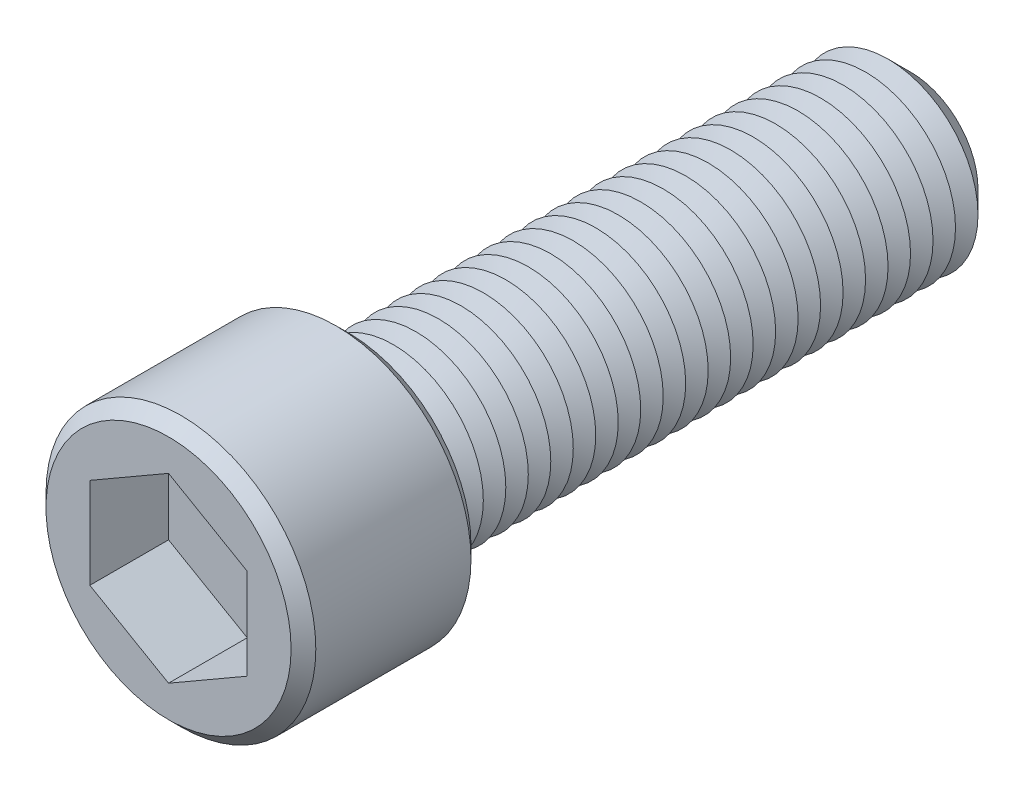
ISO-10303-21;
HEADER;
FILE_DESCRIPTION(('STEP AP214'),'2;1');
FILE_NAME('part.step','',(''),(''),'','','');
FILE_SCHEMA(('AUTOMOTIVE_DESIGN { 1 0 10303 214 1 1 1 1 }'));
ENDSEC;
DATA;
#1=APPLICATION_CONTEXT('core data for automotive mechanical design processes');
#2=APPLICATION_PROTOCOL_DEFINITION('international standard','automotive_design',2000,#1);
#3=PRODUCT_CONTEXT('',#1,'mechanical');
#4=PRODUCT('Part','Part','',(#3));
#5=PRODUCT_RELATED_PRODUCT_CATEGORY('part','',(#4));
#6=PRODUCT_DEFINITION_FORMATION('','',#4);
#7=PRODUCT_DEFINITION_CONTEXT('part definition',#1,'design');
#8=PRODUCT_DEFINITION('design','',#6,#7);
#9=PRODUCT_DEFINITION_SHAPE('','',#8);
#10=(LENGTH_UNIT() NAMED_UNIT(*) SI_UNIT(.MILLI.,.METRE.));
#11=(NAMED_UNIT(*) PLANE_ANGLE_UNIT() SI_UNIT($,.RADIAN.));
#12=(NAMED_UNIT(*) SI_UNIT($,.STERADIAN.) SOLID_ANGLE_UNIT());
#13=UNCERTAINTY_MEASURE_WITH_UNIT(LENGTH_MEASURE(1.E-05),#10,'distance_accuracy_value','');
#14=(GEOMETRIC_REPRESENTATION_CONTEXT(3) GLOBAL_UNCERTAINTY_ASSIGNED_CONTEXT((#13)) GLOBAL_UNIT_ASSIGNED_CONTEXT((#10,
#11,#12)) REPRESENTATION_CONTEXT('',''));
#15=CARTESIAN_POINT('',(0.,0.,0.));
#16=DIRECTION('',(0.,0.,1.));
#17=DIRECTION('',(1.,0.,0.));
#18=AXIS2_PLACEMENT_3D('',#15,#16,#17);
#19=CARTESIAN_POINT('',(0.,0.,16.));
#20=DIRECTION('',(0.,0.,-1.));
#21=DIRECTION('',(-1.,0.,0.));
#22=AXIS2_PLACEMENT_3D('',#19,#20,#21);
#23=CYLINDRICAL_SURFACE('',#22,12.);
#24=CARTESIAN_POINT('',(0.,0.,1.10000000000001));
#25=DIRECTION('',(0.,0.,1.));
#26=DIRECTION('',(1.,0.,0.));
#27=AXIS2_PLACEMENT_3D('',#24,#25,#26);
#28=CIRCLE('',#27,12.);
#29=CARTESIAN_POINT('',(12.,0.,1.10000000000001));
#30=VERTEX_POINT('',#29);
#31=EDGE_CURVE('E368',#30,#30,#28,.T.);
#32=ORIENTED_EDGE('',*,*,#31,.T.);
#33=EDGE_LOOP('',(#32));
#34=FACE_BOUND('',#33,.T.);
#35=CARTESIAN_POINT('',(0.,0.,14.9));
#36=DIRECTION('',(0.,0.,1.));
#37=DIRECTION('',(1.,0.,0.));
#38=AXIS2_PLACEMENT_3D('',#35,#36,#37);
#39=CIRCLE('',#38,12.);
#40=CARTESIAN_POINT('',(12.,0.,14.9));
#41=VERTEX_POINT('',#40);
#42=EDGE_CURVE('E364',#41,#41,#39,.F.);
#43=ORIENTED_EDGE('',*,*,#42,.T.);
#44=EDGE_LOOP('',(#43));
#45=FACE_BOUND('',#44,.T.);
#46=ADVANCED_FACE('F39',(#34,#45),#23,.T.);
#47=CARTESIAN_POINT('',(0.,0.,16.));
#48=DIRECTION('',(0.,0.,1.));
#49=DIRECTION('',(1.,0.,0.));
#50=AXIS2_PLACEMENT_3D('',#47,#48,#49);
#51=PLANE('',#50);
#52=CARTESIAN_POINT('',(0.,0.,16.));
#53=DIRECTION('',(0.,0.,1.));
#54=DIRECTION('',(1.,0.,0.));
#55=AXIS2_PLACEMENT_3D('',#52,#53,#54);
#56=CIRCLE('',#55,10.9);
#57=CARTESIAN_POINT('',(10.9,0.,16.));
#58=VERTEX_POINT('',#57);
#59=EDGE_CURVE('E11',#58,#58,#56,.T.);
#60=ORIENTED_EDGE('',*,*,#59,.T.);
#61=EDGE_LOOP('',(#60));
#62=FACE_BOUND('',#61,.T.);
#63=DIRECTION('',(-0.866025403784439,0.5,0.));
#64=VECTOR('',#63,1.);
#65=CARTESIAN_POINT('',(7.,4.04145188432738,16.));
#66=LINE('',#65,#64);
#67=CARTESIAN_POINT('',(7.,4.04145188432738,16.));
#68=VERTEX_POINT('',#67);
#69=CARTESIAN_POINT('',(0.,8.08290376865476,16.));
#70=VERTEX_POINT('',#69);
#71=EDGE_CURVE('E55',#68,#70,#66,.T.);
#72=ORIENTED_EDGE('',*,*,#71,.F.);
#73=DIRECTION('',(0.,1.,0.));
#74=VECTOR('',#73,1.);
#75=CARTESIAN_POINT('',(7.,-4.04145188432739,16.));
#76=LINE('',#75,#74);
#77=CARTESIAN_POINT('',(7.,-4.04145188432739,16.));
#78=VERTEX_POINT('',#77);
#79=EDGE_CURVE('E151',#78,#68,#76,.T.);
#80=ORIENTED_EDGE('',*,*,#79,.F.);
#81=DIRECTION('',(0.866025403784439,0.5,0.));
#82=VECTOR('',#81,1.);
#83=CARTESIAN_POINT('',(0.,-8.08290376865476,16.));
#84=LINE('',#83,#82);
#85=CARTESIAN_POINT('',(0.,-8.08290376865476,16.));
#86=VERTEX_POINT('',#85);
#87=EDGE_CURVE('E148',#86,#78,#84,.T.);
#88=ORIENTED_EDGE('',*,*,#87,.F.);
#89=DIRECTION('',(0.866025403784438,-0.5,0.));
#90=VECTOR('',#89,1.);
#91=CARTESIAN_POINT('',(-7.,-4.04145188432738,16.));
#92=LINE('',#91,#90);
#93=CARTESIAN_POINT('',(-7.,-4.04145188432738,16.));
#94=VERTEX_POINT('',#93);
#95=EDGE_CURVE('E103',#94,#86,#92,.T.);
#96=ORIENTED_EDGE('',*,*,#95,.F.);
#97=DIRECTION('',(0.,-1.,0.));
#98=VECTOR('',#97,1.);
#99=CARTESIAN_POINT('',(-7.,4.04145188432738,16.));
#100=LINE('',#99,#98);
#101=CARTESIAN_POINT('',(-7.,4.04145188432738,16.));
#102=VERTEX_POINT('',#101);
#103=EDGE_CURVE('E142',#102,#94,#100,.T.);
#104=ORIENTED_EDGE('',*,*,#103,.F.);
#105=DIRECTION('',(-0.866025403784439,-0.5,0.));
#106=VECTOR('',#105,1.);
#107=CARTESIAN_POINT('',(0.,8.08290376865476,16.));
#108=LINE('',#107,#106);
#109=EDGE_CURVE('E137',#70,#102,#108,.T.);
#110=ORIENTED_EDGE('',*,*,#109,.F.);
#111=EDGE_LOOP('',(#72,#80,#88,#96,#104,#110));
#112=FACE_BOUND('',#111,.T.);
#113=ADVANCED_FACE('F386',(#62,#112),#51,.T.);
#114=CARTESIAN_POINT('',(0.,0.,0.));
#115=DIRECTION('',(0.,0.,1.));
#116=DIRECTION('',(1.,0.,0.));
#117=AXIS2_PLACEMENT_3D('',#114,#115,#116);
#118=PLANE('',#117);
#119=CARTESIAN_POINT('',(0.,0.,0.));
#120=DIRECTION('',(0.,0.,1.));
#121=DIRECTION('',(1.,0.,0.));
#122=AXIS2_PLACEMENT_3D('',#119,#120,#121);
#123=CIRCLE('',#122,10.9);
#124=CARTESIAN_POINT('',(10.9,0.,0.));
#125=VERTEX_POINT('',#124);
#126=EDGE_CURVE('E48',#125,#125,#123,.F.);
#127=ORIENTED_EDGE('',*,*,#126,.T.);
#128=EDGE_LOOP('',(#127));
#129=FACE_BOUND('',#128,.T.);
#130=CARTESIAN_POINT('',(0.,0.,0.));
#131=DIRECTION('',(0.,0.,1.));
#132=DIRECTION('',(1.,0.,0.));
#133=AXIS2_PLACEMENT_3D('',#130,#131,#132);
#134=CIRCLE('',#133,8.);
#135=CARTESIAN_POINT('',(8.,0.,0.));
#136=VERTEX_POINT('',#135);
#137=EDGE_CURVE('E356',#136,#136,#134,.T.);
#138=ORIENTED_EDGE('',*,*,#137,.T.);
#139=EDGE_LOOP('',(#138));
#140=FACE_BOUND('',#139,.T.);
#141=ADVANCED_FACE('F375',(#129,#140),#118,.F.);
#142=CARTESIAN_POINT('',(0.,0.,0.));
#143=DIRECTION('',(0.,0.,1.));
#144=DIRECTION('',(1.,0.,0.));
#145=AXIS2_PLACEMENT_3D('',#142,#143,#144);
#146=CONICAL_SURFACE('',#145,8.,1.0471975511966);
#147=CARTESIAN_POINT('',(0.,0.,-1.));
#148=DIRECTION('',(0.,0.,1.));
#149=DIRECTION('',(1.,0.,0.));
#150=AXIS2_PLACEMENT_3D('',#147,#148,#149);
#151=CIRCLE('',#150,6.26794919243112);
#152=CARTESIAN_POINT('',(6.26794919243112,0.,-1.));
#153=VERTEX_POINT('',#152);
#154=EDGE_CURVE('E352',#153,#153,#151,.T.);
#155=ORIENTED_EDGE('',*,*,#154,.T.);
#156=EDGE_LOOP('',(#155));
#157=FACE_BOUND('',#156,.T.);
#158=ORIENTED_EDGE('',*,*,#137,.F.);
#159=EDGE_LOOP('',(#158));
#160=FACE_BOUND('',#159,.T.);
#161=ADVANCED_FACE('F628',(#157,#160),#146,.T.);
#162=CARTESIAN_POINT('',(0.,0.,-1.));
#163=DIRECTION('',(0.,0.,-1.));
#164=DIRECTION('',(-1.,0.,0.));
#165=AXIS2_PLACEMENT_3D('',#162,#163,#164);
#166=CONICAL_SURFACE('',#165,6.26794919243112,1.0471975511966);
#167=CARTESIAN_POINT('',(0.,0.,-2.));
#168=DIRECTION('',(0.,0.,1.));
#169=DIRECTION('',(1.,0.,0.));
#170=AXIS2_PLACEMENT_3D('',#167,#168,#169);
#171=CIRCLE('',#170,8.);
#172=CARTESIAN_POINT('',(8.,0.,-2.));
#173=VERTEX_POINT('',#172);
#174=EDGE_CURVE('E348',#173,#173,#171,.T.);
#175=ORIENTED_EDGE('',*,*,#174,.T.);
#176=EDGE_LOOP('',(#175));
#177=FACE_BOUND('',#176,.T.);
#178=ORIENTED_EDGE('',*,*,#154,.F.);
#179=EDGE_LOOP('',(#178));
#180=FACE_BOUND('',#179,.T.);
#181=ADVANCED_FACE('F624',(#177,#180),#166,.T.);
#182=CARTESIAN_POINT('',(0.,0.,-2.));
#183=DIRECTION('',(0.,0.,1.));
#184=DIRECTION('',(1.,0.,0.));
#185=AXIS2_PLACEMENT_3D('',#182,#183,#184);
#186=CONICAL_SURFACE('',#185,8.,1.0471975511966);
#187=CARTESIAN_POINT('',(0.,0.,-3.));
#188=DIRECTION('',(0.,0.,1.));
#189=DIRECTION('',(1.,0.,0.));
#190=AXIS2_PLACEMENT_3D('',#187,#188,#189);
#191=CIRCLE('',#190,6.26794919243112);
#192=CARTESIAN_POINT('',(6.26794919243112,0.,-3.));
#193=VERTEX_POINT('',#192);
#194=EDGE_CURVE('E344',#193,#193,#191,.T.);
#195=ORIENTED_EDGE('',*,*,#194,.T.);
#196=EDGE_LOOP('',(#195));
#197=FACE_BOUND('',#196,.T.);
#198=ORIENTED_EDGE('',*,*,#174,.F.);
#199=EDGE_LOOP('',(#198));
#200=FACE_BOUND('',#199,.T.);
#201=ADVANCED_FACE('F620',(#197,#200),#186,.T.);
#202=CARTESIAN_POINT('',(0.,0.,-3.));
#203=DIRECTION('',(0.,0.,-1.));
#204=DIRECTION('',(-1.,0.,0.));
#205=AXIS2_PLACEMENT_3D('',#202,#203,#204);
#206=CONICAL_SURFACE('',#205,6.26794919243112,1.0471975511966);
#207=CARTESIAN_POINT('',(0.,0.,-4.));
#208=DIRECTION('',(0.,0.,1.));
#209=DIRECTION('',(1.,0.,0.));
#210=AXIS2_PLACEMENT_3D('',#207,#208,#209);
#211=CIRCLE('',#210,8.);
#212=CARTESIAN_POINT('',(8.,0.,-4.));
#213=VERTEX_POINT('',#212);
#214=EDGE_CURVE('E340',#213,#213,#211,.T.);
#215=ORIENTED_EDGE('',*,*,#214,.T.);
#216=EDGE_LOOP('',(#215));
#217=FACE_BOUND('',#216,.T.);
#218=ORIENTED_EDGE('',*,*,#194,.F.);
#219=EDGE_LOOP('',(#218));
#220=FACE_BOUND('',#219,.T.);
#221=ADVANCED_FACE('F616',(#217,#220),#206,.T.);
#222=CARTESIAN_POINT('',(0.,0.,-4.));
#223=DIRECTION('',(0.,0.,1.));
#224=DIRECTION('',(1.,0.,0.));
#225=AXIS2_PLACEMENT_3D('',#222,#223,#224);
#226=CONICAL_SURFACE('',#225,8.,1.0471975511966);
#227=CARTESIAN_POINT('',(0.,0.,-5.));
#228=DIRECTION('',(0.,0.,1.));
#229=DIRECTION('',(1.,0.,0.));
#230=AXIS2_PLACEMENT_3D('',#227,#228,#229);
#231=CIRCLE('',#230,6.26794919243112);
#232=CARTESIAN_POINT('',(6.26794919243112,0.,-5.));
#233=VERTEX_POINT('',#232);
#234=EDGE_CURVE('E336',#233,#233,#231,.T.);
#235=ORIENTED_EDGE('',*,*,#234,.T.);
#236=EDGE_LOOP('',(#235));
#237=FACE_BOUND('',#236,.T.);
#238=ORIENTED_EDGE('',*,*,#214,.F.);
#239=EDGE_LOOP('',(#238));
#240=FACE_BOUND('',#239,.T.);
#241=ADVANCED_FACE('F612',(#237,#240),#226,.T.);
#242=CARTESIAN_POINT('',(0.,0.,-5.));
#243=DIRECTION('',(0.,0.,-1.));
#244=DIRECTION('',(-1.,0.,0.));
#245=AXIS2_PLACEMENT_3D('',#242,#243,#244);
#246=CONICAL_SURFACE('',#245,6.26794919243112,1.0471975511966);
#247=CARTESIAN_POINT('',(0.,0.,-6.));
#248=DIRECTION('',(0.,0.,1.));
#249=DIRECTION('',(1.,0.,0.));
#250=AXIS2_PLACEMENT_3D('',#247,#248,#249);
#251=CIRCLE('',#250,8.);
#252=CARTESIAN_POINT('',(8.,0.,-6.));
#253=VERTEX_POINT('',#252);
#254=EDGE_CURVE('E332',#253,#253,#251,.T.);
#255=ORIENTED_EDGE('',*,*,#254,.T.);
#256=EDGE_LOOP('',(#255));
#257=FACE_BOUND('',#256,.T.);
#258=ORIENTED_EDGE('',*,*,#234,.F.);
#259=EDGE_LOOP('',(#258));
#260=FACE_BOUND('',#259,.T.);
#261=ADVANCED_FACE('F608',(#257,#260),#246,.T.);
#262=CARTESIAN_POINT('',(0.,0.,-6.));
#263=DIRECTION('',(0.,0.,1.));
#264=DIRECTION('',(1.,0.,0.));
#265=AXIS2_PLACEMENT_3D('',#262,#263,#264);
#266=CONICAL_SURFACE('',#265,8.,1.0471975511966);
#267=CARTESIAN_POINT('',(0.,0.,-7.));
#268=DIRECTION('',(0.,0.,1.));
#269=DIRECTION('',(1.,0.,0.));
#270=AXIS2_PLACEMENT_3D('',#267,#268,#269);
#271=CIRCLE('',#270,6.26794919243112);
#272=CARTESIAN_POINT('',(6.26794919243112,0.,-7.));
#273=VERTEX_POINT('',#272);
#274=EDGE_CURVE('E328',#273,#273,#271,.T.);
#275=ORIENTED_EDGE('',*,*,#274,.T.);
#276=EDGE_LOOP('',(#275));
#277=FACE_BOUND('',#276,.T.);
#278=ORIENTED_EDGE('',*,*,#254,.F.);
#279=EDGE_LOOP('',(#278));
#280=FACE_BOUND('',#279,.T.);
#281=ADVANCED_FACE('F604',(#277,#280),#266,.T.);
#282=CARTESIAN_POINT('',(0.,0.,-7.));
#283=DIRECTION('',(0.,0.,-1.));
#284=DIRECTION('',(-1.,0.,0.));
#285=AXIS2_PLACEMENT_3D('',#282,#283,#284);
#286=CONICAL_SURFACE('',#285,6.26794919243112,1.0471975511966);
#287=CARTESIAN_POINT('',(0.,0.,-8.));
#288=DIRECTION('',(0.,0.,1.));
#289=DIRECTION('',(1.,0.,0.));
#290=AXIS2_PLACEMENT_3D('',#287,#288,#289);
#291=CIRCLE('',#290,8.);
#292=CARTESIAN_POINT('',(8.,0.,-8.));
#293=VERTEX_POINT('',#292);
#294=EDGE_CURVE('E324',#293,#293,#291,.T.);
#295=ORIENTED_EDGE('',*,*,#294,.T.);
#296=EDGE_LOOP('',(#295));
#297=FACE_BOUND('',#296,.T.);
#298=ORIENTED_EDGE('',*,*,#274,.F.);
#299=EDGE_LOOP('',(#298));
#300=FACE_BOUND('',#299,.T.);
#301=ADVANCED_FACE('F600',(#297,#300),#286,.T.);
#302=CARTESIAN_POINT('',(0.,0.,-8.));
#303=DIRECTION('',(0.,0.,1.));
#304=DIRECTION('',(1.,0.,0.));
#305=AXIS2_PLACEMENT_3D('',#302,#303,#304);
#306=CONICAL_SURFACE('',#305,8.,1.0471975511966);
#307=CARTESIAN_POINT('',(0.,0.,-9.));
#308=DIRECTION('',(0.,0.,1.));
#309=DIRECTION('',(1.,0.,0.));
#310=AXIS2_PLACEMENT_3D('',#307,#308,#309);
#311=CIRCLE('',#310,6.26794919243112);
#312=CARTESIAN_POINT('',(6.26794919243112,0.,-9.));
#313=VERTEX_POINT('',#312);
#314=EDGE_CURVE('E320',#313,#313,#311,.T.);
#315=ORIENTED_EDGE('',*,*,#314,.T.);
#316=EDGE_LOOP('',(#315));
#317=FACE_BOUND('',#316,.T.);
#318=ORIENTED_EDGE('',*,*,#294,.F.);
#319=EDGE_LOOP('',(#318));
#320=FACE_BOUND('',#319,.T.);
#321=ADVANCED_FACE('F596',(#317,#320),#306,.T.);
#322=CARTESIAN_POINT('',(0.,0.,-9.));
#323=DIRECTION('',(0.,0.,-1.));
#324=DIRECTION('',(-1.,0.,0.));
#325=AXIS2_PLACEMENT_3D('',#322,#323,#324);
#326=CONICAL_SURFACE('',#325,6.26794919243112,1.0471975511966);
#327=CARTESIAN_POINT('',(0.,0.,-10.));
#328=DIRECTION('',(0.,0.,1.));
#329=DIRECTION('',(1.,0.,0.));
#330=AXIS2_PLACEMENT_3D('',#327,#328,#329);
#331=CIRCLE('',#330,8.);
#332=CARTESIAN_POINT('',(8.,0.,-10.));
#333=VERTEX_POINT('',#332);
#334=EDGE_CURVE('E316',#333,#333,#331,.T.);
#335=ORIENTED_EDGE('',*,*,#334,.T.);
#336=EDGE_LOOP('',(#335));
#337=FACE_BOUND('',#336,.T.);
#338=ORIENTED_EDGE('',*,*,#314,.F.);
#339=EDGE_LOOP('',(#338));
#340=FACE_BOUND('',#339,.T.);
#341=ADVANCED_FACE('F592',(#337,#340),#326,.T.);
#342=CARTESIAN_POINT('',(0.,0.,-10.));
#343=DIRECTION('',(0.,0.,1.));
#344=DIRECTION('',(1.,0.,0.));
#345=AXIS2_PLACEMENT_3D('',#342,#343,#344);
#346=CONICAL_SURFACE('',#345,8.,1.0471975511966);
#347=CARTESIAN_POINT('',(0.,0.,-11.));
#348=DIRECTION('',(0.,0.,1.));
#349=DIRECTION('',(1.,0.,0.));
#350=AXIS2_PLACEMENT_3D('',#347,#348,#349);
#351=CIRCLE('',#350,6.26794919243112);
#352=CARTESIAN_POINT('',(6.26794919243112,0.,-11.));
#353=VERTEX_POINT('',#352);
#354=EDGE_CURVE('E312',#353,#353,#351,.T.);
#355=ORIENTED_EDGE('',*,*,#354,.T.);
#356=EDGE_LOOP('',(#355));
#357=FACE_BOUND('',#356,.T.);
#358=ORIENTED_EDGE('',*,*,#334,.F.);
#359=EDGE_LOOP('',(#358));
#360=FACE_BOUND('',#359,.T.);
#361=ADVANCED_FACE('F588',(#357,#360),#346,.T.);
#362=CARTESIAN_POINT('',(0.,0.,-11.));
#363=DIRECTION('',(0.,0.,-1.));
#364=DIRECTION('',(-1.,0.,0.));
#365=AXIS2_PLACEMENT_3D('',#362,#363,#364);
#366=CONICAL_SURFACE('',#365,6.26794919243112,1.0471975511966);
#367=CARTESIAN_POINT('',(0.,0.,-12.));
#368=DIRECTION('',(0.,0.,1.));
#369=DIRECTION('',(1.,0.,0.));
#370=AXIS2_PLACEMENT_3D('',#367,#368,#369);
#371=CIRCLE('',#370,8.);
#372=CARTESIAN_POINT('',(8.,0.,-12.));
#373=VERTEX_POINT('',#372);
#374=EDGE_CURVE('E308',#373,#373,#371,.T.);
#375=ORIENTED_EDGE('',*,*,#374,.T.);
#376=EDGE_LOOP('',(#375));
#377=FACE_BOUND('',#376,.T.);
#378=ORIENTED_EDGE('',*,*,#354,.F.);
#379=EDGE_LOOP('',(#378));
#380=FACE_BOUND('',#379,.T.);
#381=ADVANCED_FACE('F584',(#377,#380),#366,.T.);
#382=CARTESIAN_POINT('',(0.,0.,-12.));
#383=DIRECTION('',(0.,0.,1.));
#384=DIRECTION('',(1.,0.,0.));
#385=AXIS2_PLACEMENT_3D('',#382,#383,#384);
#386=CONICAL_SURFACE('',#385,8.,1.0471975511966);
#387=CARTESIAN_POINT('',(0.,0.,-13.));
#388=DIRECTION('',(0.,0.,1.));
#389=DIRECTION('',(1.,0.,0.));
#390=AXIS2_PLACEMENT_3D('',#387,#388,#389);
#391=CIRCLE('',#390,6.26794919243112);
#392=CARTESIAN_POINT('',(6.26794919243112,0.,-13.));
#393=VERTEX_POINT('',#392);
#394=EDGE_CURVE('E304',#393,#393,#391,.T.);
#395=ORIENTED_EDGE('',*,*,#394,.T.);
#396=EDGE_LOOP('',(#395));
#397=FACE_BOUND('',#396,.T.);
#398=ORIENTED_EDGE('',*,*,#374,.F.);
#399=EDGE_LOOP('',(#398));
#400=FACE_BOUND('',#399,.T.);
#401=ADVANCED_FACE('F580',(#397,#400),#386,.T.);
#402=CARTESIAN_POINT('',(0.,0.,-13.));
#403=DIRECTION('',(0.,0.,-1.));
#404=DIRECTION('',(-1.,0.,0.));
#405=AXIS2_PLACEMENT_3D('',#402,#403,#404);
#406=CONICAL_SURFACE('',#405,6.26794919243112,1.0471975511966);
#407=CARTESIAN_POINT('',(0.,0.,-14.));
#408=DIRECTION('',(0.,0.,1.));
#409=DIRECTION('',(1.,0.,0.));
#410=AXIS2_PLACEMENT_3D('',#407,#408,#409);
#411=CIRCLE('',#410,8.);
#412=CARTESIAN_POINT('',(8.,0.,-14.));
#413=VERTEX_POINT('',#412);
#414=EDGE_CURVE('E300',#413,#413,#411,.T.);
#415=ORIENTED_EDGE('',*,*,#414,.T.);
#416=EDGE_LOOP('',(#415));
#417=FACE_BOUND('',#416,.T.);
#418=ORIENTED_EDGE('',*,*,#394,.F.);
#419=EDGE_LOOP('',(#418));
#420=FACE_BOUND('',#419,.T.);
#421=ADVANCED_FACE('F576',(#417,#420),#406,.T.);
#422=CARTESIAN_POINT('',(0.,0.,-14.));
#423=DIRECTION('',(0.,0.,1.));
#424=DIRECTION('',(1.,0.,0.));
#425=AXIS2_PLACEMENT_3D('',#422,#423,#424);
#426=CONICAL_SURFACE('',#425,8.,1.0471975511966);
#427=CARTESIAN_POINT('',(0.,0.,-15.));
#428=DIRECTION('',(0.,0.,1.));
#429=DIRECTION('',(1.,0.,0.));
#430=AXIS2_PLACEMENT_3D('',#427,#428,#429);
#431=CIRCLE('',#430,6.26794919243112);
#432=CARTESIAN_POINT('',(6.26794919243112,0.,-15.));
#433=VERTEX_POINT('',#432);
#434=EDGE_CURVE('E296',#433,#433,#431,.T.);
#435=ORIENTED_EDGE('',*,*,#434,.T.);
#436=EDGE_LOOP('',(#435));
#437=FACE_BOUND('',#436,.T.);
#438=ORIENTED_EDGE('',*,*,#414,.F.);
#439=EDGE_LOOP('',(#438));
#440=FACE_BOUND('',#439,.T.);
#441=ADVANCED_FACE('F572',(#437,#440),#426,.T.);
#442=CARTESIAN_POINT('',(0.,0.,-15.));
#443=DIRECTION('',(0.,0.,-1.));
#444=DIRECTION('',(-1.,0.,0.));
#445=AXIS2_PLACEMENT_3D('',#442,#443,#444);
#446=CONICAL_SURFACE('',#445,6.26794919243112,1.0471975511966);
#447=CARTESIAN_POINT('',(0.,0.,-16.));
#448=DIRECTION('',(0.,0.,1.));
#449=DIRECTION('',(1.,0.,0.));
#450=AXIS2_PLACEMENT_3D('',#447,#448,#449);
#451=CIRCLE('',#450,8.);
#452=CARTESIAN_POINT('',(8.,0.,-16.));
#453=VERTEX_POINT('',#452);
#454=EDGE_CURVE('E293',#453,#453,#451,.T.);
#455=ORIENTED_EDGE('',*,*,#454,.T.);
#456=EDGE_LOOP('',(#455));
#457=FACE_BOUND('',#456,.T.);
#458=ORIENTED_EDGE('',*,*,#434,.F.);
#459=EDGE_LOOP('',(#458));
#460=FACE_BOUND('',#459,.T.);
#461=ADVANCED_FACE('F568',(#457,#460),#446,.T.);
#462=CARTESIAN_POINT('',(0.,0.,-16.));
#463=DIRECTION('',(0.,0.,1.));
#464=DIRECTION('',(1.,0.,0.));
#465=AXIS2_PLACEMENT_3D('',#462,#463,#464);
#466=CONICAL_SURFACE('',#465,8.,1.0471975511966);
#467=CARTESIAN_POINT('',(0.,0.,-17.));
#468=DIRECTION('',(0.,0.,1.));
#469=DIRECTION('',(1.,0.,0.));
#470=AXIS2_PLACEMENT_3D('',#467,#468,#469);
#471=CIRCLE('',#470,6.26794919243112);
#472=CARTESIAN_POINT('',(6.26794919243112,0.,-17.));
#473=VERTEX_POINT('',#472);
#474=EDGE_CURVE('E289',#473,#473,#471,.T.);
#475=ORIENTED_EDGE('',*,*,#474,.T.);
#476=EDGE_LOOP('',(#475));
#477=FACE_BOUND('',#476,.T.);
#478=ORIENTED_EDGE('',*,*,#454,.F.);
#479=EDGE_LOOP('',(#478));
#480=FACE_BOUND('',#479,.T.);
#481=ADVANCED_FACE('F564',(#477,#480),#466,.T.);
#482=CARTESIAN_POINT('',(0.,0.,-17.));
#483=DIRECTION('',(0.,0.,-1.));
#484=DIRECTION('',(-1.,0.,0.));
#485=AXIS2_PLACEMENT_3D('',#482,#483,#484);
#486=CONICAL_SURFACE('',#485,6.26794919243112,1.0471975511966);
#487=CARTESIAN_POINT('',(0.,0.,-18.));
#488=DIRECTION('',(0.,0.,1.));
#489=DIRECTION('',(1.,0.,0.));
#490=AXIS2_PLACEMENT_3D('',#487,#488,#489);
#491=CIRCLE('',#490,8.);
#492=CARTESIAN_POINT('',(8.,0.,-18.));
#493=VERTEX_POINT('',#492);
#494=EDGE_CURVE('E285',#493,#493,#491,.T.);
#495=ORIENTED_EDGE('',*,*,#494,.T.);
#496=EDGE_LOOP('',(#495));
#497=FACE_BOUND('',#496,.T.);
#498=ORIENTED_EDGE('',*,*,#474,.F.);
#499=EDGE_LOOP('',(#498));
#500=FACE_BOUND('',#499,.T.);
#501=ADVANCED_FACE('F560',(#497,#500),#486,.T.);
#502=CARTESIAN_POINT('',(0.,0.,-18.));
#503=DIRECTION('',(0.,0.,1.));
#504=DIRECTION('',(1.,0.,0.));
#505=AXIS2_PLACEMENT_3D('',#502,#503,#504);
#506=CONICAL_SURFACE('',#505,8.,1.0471975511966);
#507=CARTESIAN_POINT('',(0.,0.,-19.));
#508=DIRECTION('',(0.,0.,1.));
#509=DIRECTION('',(1.,0.,0.));
#510=AXIS2_PLACEMENT_3D('',#507,#508,#509);
#511=CIRCLE('',#510,6.26794919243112);
#512=CARTESIAN_POINT('',(6.26794919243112,0.,-19.));
#513=VERTEX_POINT('',#512);
#514=EDGE_CURVE('E281',#513,#513,#511,.T.);
#515=ORIENTED_EDGE('',*,*,#514,.T.);
#516=EDGE_LOOP('',(#515));
#517=FACE_BOUND('',#516,.T.);
#518=ORIENTED_EDGE('',*,*,#494,.F.);
#519=EDGE_LOOP('',(#518));
#520=FACE_BOUND('',#519,.T.);
#521=ADVANCED_FACE('F556',(#517,#520),#506,.T.);
#522=CARTESIAN_POINT('',(0.,0.,-19.));
#523=DIRECTION('',(0.,0.,-1.));
#524=DIRECTION('',(-1.,0.,0.));
#525=AXIS2_PLACEMENT_3D('',#522,#523,#524);
#526=CONICAL_SURFACE('',#525,6.26794919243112,1.0471975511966);
#527=CARTESIAN_POINT('',(0.,0.,-20.));
#528=DIRECTION('',(0.,0.,1.));
#529=DIRECTION('',(1.,0.,0.));
#530=AXIS2_PLACEMENT_3D('',#527,#528,#529);
#531=CIRCLE('',#530,8.);
#532=CARTESIAN_POINT('',(8.,0.,-20.));
#533=VERTEX_POINT('',#532);
#534=EDGE_CURVE('E277',#533,#533,#531,.T.);
#535=ORIENTED_EDGE('',*,*,#534,.T.);
#536=EDGE_LOOP('',(#535));
#537=FACE_BOUND('',#536,.T.);
#538=ORIENTED_EDGE('',*,*,#514,.F.);
#539=EDGE_LOOP('',(#538));
#540=FACE_BOUND('',#539,.T.);
#541=ADVANCED_FACE('F552',(#537,#540),#526,.T.);
#542=CARTESIAN_POINT('',(0.,0.,-20.));
#543=DIRECTION('',(0.,0.,1.));
#544=DIRECTION('',(1.,0.,0.));
#545=AXIS2_PLACEMENT_3D('',#542,#543,#544);
#546=CONICAL_SURFACE('',#545,8.,1.0471975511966);
#547=CARTESIAN_POINT('',(0.,0.,-21.));
#548=DIRECTION('',(0.,0.,1.));
#549=DIRECTION('',(1.,0.,0.));
#550=AXIS2_PLACEMENT_3D('',#547,#548,#549);
#551=CIRCLE('',#550,6.26794919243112);
#552=CARTESIAN_POINT('',(6.26794919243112,0.,-21.));
#553=VERTEX_POINT('',#552);
#554=EDGE_CURVE('E273',#553,#553,#551,.T.);
#555=ORIENTED_EDGE('',*,*,#554,.T.);
#556=EDGE_LOOP('',(#555));
#557=FACE_BOUND('',#556,.T.);
#558=ORIENTED_EDGE('',*,*,#534,.F.);
#559=EDGE_LOOP('',(#558));
#560=FACE_BOUND('',#559,.T.);
#561=ADVANCED_FACE('F548',(#557,#560),#546,.T.);
#562=CARTESIAN_POINT('',(0.,0.,-21.));
#563=DIRECTION('',(0.,0.,-1.));
#564=DIRECTION('',(-1.,0.,0.));
#565=AXIS2_PLACEMENT_3D('',#562,#563,#564);
#566=CONICAL_SURFACE('',#565,6.26794919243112,1.0471975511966);
#567=CARTESIAN_POINT('',(0.,0.,-22.));
#568=DIRECTION('',(0.,0.,1.));
#569=DIRECTION('',(1.,0.,0.));
#570=AXIS2_PLACEMENT_3D('',#567,#568,#569);
#571=CIRCLE('',#570,8.);
#572=CARTESIAN_POINT('',(8.,0.,-22.));
#573=VERTEX_POINT('',#572);
#574=EDGE_CURVE('E269',#573,#573,#571,.T.);
#575=ORIENTED_EDGE('',*,*,#574,.T.);
#576=EDGE_LOOP('',(#575));
#577=FACE_BOUND('',#576,.T.);
#578=ORIENTED_EDGE('',*,*,#554,.F.);
#579=EDGE_LOOP('',(#578));
#580=FACE_BOUND('',#579,.T.);
#581=ADVANCED_FACE('F544',(#577,#580),#566,.T.);
#582=CARTESIAN_POINT('',(0.,0.,-22.));
#583=DIRECTION('',(0.,0.,1.));
#584=DIRECTION('',(1.,0.,0.));
#585=AXIS2_PLACEMENT_3D('',#582,#583,#584);
#586=CONICAL_SURFACE('',#585,8.,1.0471975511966);
#587=CARTESIAN_POINT('',(0.,0.,-23.));
#588=DIRECTION('',(0.,0.,1.));
#589=DIRECTION('',(1.,0.,0.));
#590=AXIS2_PLACEMENT_3D('',#587,#588,#589);
#591=CIRCLE('',#590,6.26794919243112);
#592=CARTESIAN_POINT('',(6.26794919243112,0.,-23.));
#593=VERTEX_POINT('',#592);
#594=EDGE_CURVE('E265',#593,#593,#591,.T.);
#595=ORIENTED_EDGE('',*,*,#594,.T.);
#596=EDGE_LOOP('',(#595));
#597=FACE_BOUND('',#596,.T.);
#598=ORIENTED_EDGE('',*,*,#574,.F.);
#599=EDGE_LOOP('',(#598));
#600=FACE_BOUND('',#599,.T.);
#601=ADVANCED_FACE('F540',(#597,#600),#586,.T.);
#602=CARTESIAN_POINT('',(0.,0.,-23.));
#603=DIRECTION('',(0.,0.,-1.));
#604=DIRECTION('',(-1.,0.,0.));
#605=AXIS2_PLACEMENT_3D('',#602,#603,#604);
#606=CONICAL_SURFACE('',#605,6.26794919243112,1.0471975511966);
#607=CARTESIAN_POINT('',(0.,0.,-24.));
#608=DIRECTION('',(0.,0.,1.));
#609=DIRECTION('',(1.,0.,0.));
#610=AXIS2_PLACEMENT_3D('',#607,#608,#609);
#611=CIRCLE('',#610,8.);
#612=CARTESIAN_POINT('',(8.,0.,-24.));
#613=VERTEX_POINT('',#612);
#614=EDGE_CURVE('E261',#613,#613,#611,.T.);
#615=ORIENTED_EDGE('',*,*,#614,.T.);
#616=EDGE_LOOP('',(#615));
#617=FACE_BOUND('',#616,.T.);
#618=ORIENTED_EDGE('',*,*,#594,.F.);
#619=EDGE_LOOP('',(#618));
#620=FACE_BOUND('',#619,.T.);
#621=ADVANCED_FACE('F536',(#617,#620),#606,.T.);
#622=CARTESIAN_POINT('',(0.,0.,-24.));
#623=DIRECTION('',(0.,0.,1.));
#624=DIRECTION('',(1.,0.,0.));
#625=AXIS2_PLACEMENT_3D('',#622,#623,#624);
#626=CONICAL_SURFACE('',#625,8.,1.0471975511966);
#627=CARTESIAN_POINT('',(0.,0.,-25.));
#628=DIRECTION('',(0.,0.,1.));
#629=DIRECTION('',(1.,0.,0.));
#630=AXIS2_PLACEMENT_3D('',#627,#628,#629);
#631=CIRCLE('',#630,6.26794919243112);
#632=CARTESIAN_POINT('',(6.26794919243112,0.,-25.));
#633=VERTEX_POINT('',#632);
#634=EDGE_CURVE('E257',#633,#633,#631,.T.);
#635=ORIENTED_EDGE('',*,*,#634,.T.);
#636=EDGE_LOOP('',(#635));
#637=FACE_BOUND('',#636,.T.);
#638=ORIENTED_EDGE('',*,*,#614,.F.);
#639=EDGE_LOOP('',(#638));
#640=FACE_BOUND('',#639,.T.);
#641=ADVANCED_FACE('F532',(#637,#640),#626,.T.);
#642=CARTESIAN_POINT('',(0.,0.,-25.));
#643=DIRECTION('',(0.,0.,-1.));
#644=DIRECTION('',(-1.,0.,0.));
#645=AXIS2_PLACEMENT_3D('',#642,#643,#644);
#646=CONICAL_SURFACE('',#645,6.26794919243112,1.0471975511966);
#647=CARTESIAN_POINT('',(0.,0.,-26.));
#648=DIRECTION('',(0.,0.,1.));
#649=DIRECTION('',(1.,0.,0.));
#650=AXIS2_PLACEMENT_3D('',#647,#648,#649);
#651=CIRCLE('',#650,8.);
#652=CARTESIAN_POINT('',(8.,0.,-26.));
#653=VERTEX_POINT('',#652);
#654=EDGE_CURVE('E253',#653,#653,#651,.T.);
#655=ORIENTED_EDGE('',*,*,#654,.T.);
#656=EDGE_LOOP('',(#655));
#657=FACE_BOUND('',#656,.T.);
#658=ORIENTED_EDGE('',*,*,#634,.F.);
#659=EDGE_LOOP('',(#658));
#660=FACE_BOUND('',#659,.T.);
#661=ADVANCED_FACE('F528',(#657,#660),#646,.T.);
#662=CARTESIAN_POINT('',(0.,0.,-26.));
#663=DIRECTION('',(0.,0.,1.));
#664=DIRECTION('',(1.,0.,0.));
#665=AXIS2_PLACEMENT_3D('',#662,#663,#664);
#666=CONICAL_SURFACE('',#665,8.,1.0471975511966);
#667=CARTESIAN_POINT('',(0.,0.,-27.));
#668=DIRECTION('',(0.,0.,1.));
#669=DIRECTION('',(1.,0.,0.));
#670=AXIS2_PLACEMENT_3D('',#667,#668,#669);
#671=CIRCLE('',#670,6.26794919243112);
#672=CARTESIAN_POINT('',(6.26794919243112,0.,-27.));
#673=VERTEX_POINT('',#672);
#674=EDGE_CURVE('E249',#673,#673,#671,.T.);
#675=ORIENTED_EDGE('',*,*,#674,.T.);
#676=EDGE_LOOP('',(#675));
#677=FACE_BOUND('',#676,.T.);
#678=ORIENTED_EDGE('',*,*,#654,.F.);
#679=EDGE_LOOP('',(#678));
#680=FACE_BOUND('',#679,.T.);
#681=ADVANCED_FACE('F524',(#677,#680),#666,.T.);
#682=CARTESIAN_POINT('',(0.,0.,-27.));
#683=DIRECTION('',(0.,0.,-1.));
#684=DIRECTION('',(-1.,0.,0.));
#685=AXIS2_PLACEMENT_3D('',#682,#683,#684);
#686=CONICAL_SURFACE('',#685,6.26794919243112,1.0471975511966);
#687=CARTESIAN_POINT('',(0.,0.,-28.));
#688=DIRECTION('',(0.,0.,1.));
#689=DIRECTION('',(1.,0.,0.));
#690=AXIS2_PLACEMENT_3D('',#687,#688,#689);
#691=CIRCLE('',#690,8.);
#692=CARTESIAN_POINT('',(8.,0.,-28.));
#693=VERTEX_POINT('',#692);
#694=EDGE_CURVE('E245',#693,#693,#691,.T.);
#695=ORIENTED_EDGE('',*,*,#694,.T.);
#696=EDGE_LOOP('',(#695));
#697=FACE_BOUND('',#696,.T.);
#698=ORIENTED_EDGE('',*,*,#674,.F.);
#699=EDGE_LOOP('',(#698));
#700=FACE_BOUND('',#699,.T.);
#701=ADVANCED_FACE('F520',(#697,#700),#686,.T.);
#702=CARTESIAN_POINT('',(0.,0.,-28.));
#703=DIRECTION('',(0.,0.,1.));
#704=DIRECTION('',(1.,0.,0.));
#705=AXIS2_PLACEMENT_3D('',#702,#703,#704);
#706=CONICAL_SURFACE('',#705,8.,1.0471975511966);
#707=CARTESIAN_POINT('',(0.,0.,-29.));
#708=DIRECTION('',(0.,0.,1.));
#709=DIRECTION('',(1.,0.,0.));
#710=AXIS2_PLACEMENT_3D('',#707,#708,#709);
#711=CIRCLE('',#710,6.26794919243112);
#712=CARTESIAN_POINT('',(6.26794919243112,0.,-29.));
#713=VERTEX_POINT('',#712);
#714=EDGE_CURVE('E241',#713,#713,#711,.T.);
#715=ORIENTED_EDGE('',*,*,#714,.T.);
#716=EDGE_LOOP('',(#715));
#717=FACE_BOUND('',#716,.T.);
#718=ORIENTED_EDGE('',*,*,#694,.F.);
#719=EDGE_LOOP('',(#718));
#720=FACE_BOUND('',#719,.T.);
#721=ADVANCED_FACE('F516',(#717,#720),#706,.T.);
#722=CARTESIAN_POINT('',(0.,0.,-29.));
#723=DIRECTION('',(0.,0.,-1.));
#724=DIRECTION('',(-1.,0.,0.));
#725=AXIS2_PLACEMENT_3D('',#722,#723,#724);
#726=CONICAL_SURFACE('',#725,6.26794919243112,1.0471975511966);
#727=CARTESIAN_POINT('',(0.,0.,-30.));
#728=DIRECTION('',(0.,0.,1.));
#729=DIRECTION('',(1.,0.,0.));
#730=AXIS2_PLACEMENT_3D('',#727,#728,#729);
#731=CIRCLE('',#730,8.);
#732=CARTESIAN_POINT('',(8.,0.,-30.));
#733=VERTEX_POINT('',#732);
#734=EDGE_CURVE('E237',#733,#733,#731,.T.);
#735=ORIENTED_EDGE('',*,*,#734,.T.);
#736=EDGE_LOOP('',(#735));
#737=FACE_BOUND('',#736,.T.);
#738=ORIENTED_EDGE('',*,*,#714,.F.);
#739=EDGE_LOOP('',(#738));
#740=FACE_BOUND('',#739,.T.);
#741=ADVANCED_FACE('F512',(#737,#740),#726,.T.);
#742=CARTESIAN_POINT('',(0.,0.,-30.));
#743=DIRECTION('',(0.,0.,1.));
#744=DIRECTION('',(1.,0.,0.));
#745=AXIS2_PLACEMENT_3D('',#742,#743,#744);
#746=CONICAL_SURFACE('',#745,8.,1.0471975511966);
#747=CARTESIAN_POINT('',(0.,0.,-31.));
#748=DIRECTION('',(0.,0.,1.));
#749=DIRECTION('',(1.,0.,0.));
#750=AXIS2_PLACEMENT_3D('',#747,#748,#749);
#751=CIRCLE('',#750,6.26794919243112);
#752=CARTESIAN_POINT('',(6.26794919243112,0.,-31.));
#753=VERTEX_POINT('',#752);
#754=EDGE_CURVE('E233',#753,#753,#751,.T.);
#755=ORIENTED_EDGE('',*,*,#754,.T.);
#756=EDGE_LOOP('',(#755));
#757=FACE_BOUND('',#756,.T.);
#758=ORIENTED_EDGE('',*,*,#734,.F.);
#759=EDGE_LOOP('',(#758));
#760=FACE_BOUND('',#759,.T.);
#761=ADVANCED_FACE('F508',(#757,#760),#746,.T.);
#762=CARTESIAN_POINT('',(0.,0.,-31.));
#763=DIRECTION('',(0.,0.,-1.));
#764=DIRECTION('',(-1.,0.,0.));
#765=AXIS2_PLACEMENT_3D('',#762,#763,#764);
#766=CONICAL_SURFACE('',#765,6.26794919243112,1.0471975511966);
#767=CARTESIAN_POINT('',(0.,0.,-32.));
#768=DIRECTION('',(0.,0.,1.));
#769=DIRECTION('',(1.,0.,0.));
#770=AXIS2_PLACEMENT_3D('',#767,#768,#769);
#771=CIRCLE('',#770,8.);
#772=CARTESIAN_POINT('',(8.,0.,-32.));
#773=VERTEX_POINT('',#772);
#774=EDGE_CURVE('E229',#773,#773,#771,.T.);
#775=ORIENTED_EDGE('',*,*,#774,.T.);
#776=EDGE_LOOP('',(#775));
#777=FACE_BOUND('',#776,.T.);
#778=ORIENTED_EDGE('',*,*,#754,.F.);
#779=EDGE_LOOP('',(#778));
#780=FACE_BOUND('',#779,.T.);
#781=ADVANCED_FACE('F504',(#777,#780),#766,.T.);
#782=CARTESIAN_POINT('',(0.,0.,-32.));
#783=DIRECTION('',(0.,0.,1.));
#784=DIRECTION('',(1.,0.,0.));
#785=AXIS2_PLACEMENT_3D('',#782,#783,#784);
#786=CONICAL_SURFACE('',#785,8.,1.0471975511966);
#787=CARTESIAN_POINT('',(0.,0.,-33.));
#788=DIRECTION('',(0.,0.,1.));
#789=DIRECTION('',(1.,0.,0.));
#790=AXIS2_PLACEMENT_3D('',#787,#788,#789);
#791=CIRCLE('',#790,6.26794919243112);
#792=CARTESIAN_POINT('',(6.26794919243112,0.,-33.));
#793=VERTEX_POINT('',#792);
#794=EDGE_CURVE('E225',#793,#793,#791,.T.);
#795=ORIENTED_EDGE('',*,*,#794,.T.);
#796=EDGE_LOOP('',(#795));
#797=FACE_BOUND('',#796,.T.);
#798=ORIENTED_EDGE('',*,*,#774,.F.);
#799=EDGE_LOOP('',(#798));
#800=FACE_BOUND('',#799,.T.);
#801=ADVANCED_FACE('F500',(#797,#800),#786,.T.);
#802=CARTESIAN_POINT('',(0.,0.,-33.));
#803=DIRECTION('',(0.,0.,-1.));
#804=DIRECTION('',(-1.,0.,0.));
#805=AXIS2_PLACEMENT_3D('',#802,#803,#804);
#806=CONICAL_SURFACE('',#805,6.26794919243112,1.0471975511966);
#807=CARTESIAN_POINT('',(0.,0.,-34.));
#808=DIRECTION('',(0.,0.,1.));
#809=DIRECTION('',(1.,0.,0.));
#810=AXIS2_PLACEMENT_3D('',#807,#808,#809);
#811=CIRCLE('',#810,8.);
#812=CARTESIAN_POINT('',(8.,0.,-34.));
#813=VERTEX_POINT('',#812);
#814=EDGE_CURVE('E221',#813,#813,#811,.T.);
#815=ORIENTED_EDGE('',*,*,#814,.T.);
#816=EDGE_LOOP('',(#815));
#817=FACE_BOUND('',#816,.T.);
#818=ORIENTED_EDGE('',*,*,#794,.F.);
#819=EDGE_LOOP('',(#818));
#820=FACE_BOUND('',#819,.T.);
#821=ADVANCED_FACE('F496',(#817,#820),#806,.T.);
#822=CARTESIAN_POINT('',(0.,0.,-34.));
#823=DIRECTION('',(0.,0.,1.));
#824=DIRECTION('',(1.,0.,0.));
#825=AXIS2_PLACEMENT_3D('',#822,#823,#824);
#826=CONICAL_SURFACE('',#825,8.,1.0471975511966);
#827=CARTESIAN_POINT('',(0.,0.,-35.));
#828=DIRECTION('',(0.,0.,1.));
#829=DIRECTION('',(1.,0.,0.));
#830=AXIS2_PLACEMENT_3D('',#827,#828,#829);
#831=CIRCLE('',#830,6.26794919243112);
#832=CARTESIAN_POINT('',(6.26794919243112,0.,-35.));
#833=VERTEX_POINT('',#832);
#834=EDGE_CURVE('E217',#833,#833,#831,.T.);
#835=ORIENTED_EDGE('',*,*,#834,.T.);
#836=EDGE_LOOP('',(#835));
#837=FACE_BOUND('',#836,.T.);
#838=ORIENTED_EDGE('',*,*,#814,.F.);
#839=EDGE_LOOP('',(#838));
#840=FACE_BOUND('',#839,.T.);
#841=ADVANCED_FACE('F492',(#837,#840),#826,.T.);
#842=CARTESIAN_POINT('',(0.,0.,-35.));
#843=DIRECTION('',(0.,0.,-1.));
#844=DIRECTION('',(-1.,0.,0.));
#845=AXIS2_PLACEMENT_3D('',#842,#843,#844);
#846=CONICAL_SURFACE('',#845,6.26794919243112,1.0471975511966);
#847=CARTESIAN_POINT('',(0.,0.,-36.));
#848=DIRECTION('',(0.,0.,1.));
#849=DIRECTION('',(1.,0.,0.));
#850=AXIS2_PLACEMENT_3D('',#847,#848,#849);
#851=CIRCLE('',#850,8.);
#852=CARTESIAN_POINT('',(8.,0.,-36.));
#853=VERTEX_POINT('',#852);
#854=EDGE_CURVE('E213',#853,#853,#851,.T.);
#855=ORIENTED_EDGE('',*,*,#854,.T.);
#856=EDGE_LOOP('',(#855));
#857=FACE_BOUND('',#856,.T.);
#858=ORIENTED_EDGE('',*,*,#834,.F.);
#859=EDGE_LOOP('',(#858));
#860=FACE_BOUND('',#859,.T.);
#861=ADVANCED_FACE('F488',(#857,#860),#846,.T.);
#862=CARTESIAN_POINT('',(0.,0.,-36.));
#863=DIRECTION('',(0.,0.,1.));
#864=DIRECTION('',(1.,0.,0.));
#865=AXIS2_PLACEMENT_3D('',#862,#863,#864);
#866=CONICAL_SURFACE('',#865,8.,1.0471975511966);
#867=CARTESIAN_POINT('',(0.,0.,-37.));
#868=DIRECTION('',(0.,0.,1.));
#869=DIRECTION('',(1.,0.,0.));
#870=AXIS2_PLACEMENT_3D('',#867,#868,#869);
#871=CIRCLE('',#870,6.26794919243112);
#872=CARTESIAN_POINT('',(6.26794919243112,0.,-37.));
#873=VERTEX_POINT('',#872);
#874=EDGE_CURVE('E209',#873,#873,#871,.T.);
#875=ORIENTED_EDGE('',*,*,#874,.T.);
#876=EDGE_LOOP('',(#875));
#877=FACE_BOUND('',#876,.T.);
#878=ORIENTED_EDGE('',*,*,#854,.F.);
#879=EDGE_LOOP('',(#878));
#880=FACE_BOUND('',#879,.T.);
#881=ADVANCED_FACE('F484',(#877,#880),#866,.T.);
#882=CARTESIAN_POINT('',(0.,0.,-37.));
#883=DIRECTION('',(0.,0.,-1.));
#884=DIRECTION('',(-1.,0.,0.));
#885=AXIS2_PLACEMENT_3D('',#882,#883,#884);
#886=CONICAL_SURFACE('',#885,6.26794919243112,1.0471975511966);
#887=CARTESIAN_POINT('',(0.,0.,-38.));
#888=DIRECTION('',(0.,0.,1.));
#889=DIRECTION('',(1.,0.,0.));
#890=AXIS2_PLACEMENT_3D('',#887,#888,#889);
#891=CIRCLE('',#890,8.);
#892=CARTESIAN_POINT('',(8.,0.,-38.));
#893=VERTEX_POINT('',#892);
#894=EDGE_CURVE('E205',#893,#893,#891,.T.);
#895=ORIENTED_EDGE('',*,*,#894,.T.);
#896=EDGE_LOOP('',(#895));
#897=FACE_BOUND('',#896,.T.);
#898=ORIENTED_EDGE('',*,*,#874,.F.);
#899=EDGE_LOOP('',(#898));
#900=FACE_BOUND('',#899,.T.);
#901=ADVANCED_FACE('F480',(#897,#900),#886,.T.);
#902=CARTESIAN_POINT('',(0.,0.,-38.));
#903=DIRECTION('',(0.,0.,1.));
#904=DIRECTION('',(1.,0.,0.));
#905=AXIS2_PLACEMENT_3D('',#902,#903,#904);
#906=CONICAL_SURFACE('',#905,8.,1.0471975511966);
#907=CARTESIAN_POINT('',(0.,0.,-39.));
#908=DIRECTION('',(0.,0.,1.));
#909=DIRECTION('',(1.,0.,0.));
#910=AXIS2_PLACEMENT_3D('',#907,#908,#909);
#911=CIRCLE('',#910,6.26794919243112);
#912=CARTESIAN_POINT('',(6.26794919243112,0.,-39.));
#913=VERTEX_POINT('',#912);
#914=EDGE_CURVE('E201',#913,#913,#911,.T.);
#915=ORIENTED_EDGE('',*,*,#914,.T.);
#916=EDGE_LOOP('',(#915));
#917=FACE_BOUND('',#916,.T.);
#918=ORIENTED_EDGE('',*,*,#894,.F.);
#919=EDGE_LOOP('',(#918));
#920=FACE_BOUND('',#919,.T.);
#921=ADVANCED_FACE('F476',(#917,#920),#906,.T.);
#922=CARTESIAN_POINT('',(0.,0.,-39.));
#923=DIRECTION('',(0.,0.,-1.));
#924=DIRECTION('',(-1.,0.,0.));
#925=AXIS2_PLACEMENT_3D('',#922,#923,#924);
#926=CONICAL_SURFACE('',#925,6.26794919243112,1.0471975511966);
#927=CARTESIAN_POINT('',(0.,0.,-40.));
#928=DIRECTION('',(0.,0.,1.));
#929=DIRECTION('',(1.,0.,0.));
#930=AXIS2_PLACEMENT_3D('',#927,#928,#929);
#931=CIRCLE('',#930,8.);
#932=CARTESIAN_POINT('',(8.,0.,-40.));
#933=VERTEX_POINT('',#932);
#934=EDGE_CURVE('E197',#933,#933,#931,.T.);
#935=ORIENTED_EDGE('',*,*,#934,.T.);
#936=EDGE_LOOP('',(#935));
#937=FACE_BOUND('',#936,.T.);
#938=ORIENTED_EDGE('',*,*,#914,.F.);
#939=EDGE_LOOP('',(#938));
#940=FACE_BOUND('',#939,.T.);
#941=ADVANCED_FACE('F472',(#937,#940),#926,.T.);
#942=CARTESIAN_POINT('',(0.,0.,-40.));
#943=DIRECTION('',(0.,0.,1.));
#944=DIRECTION('',(1.,0.,0.));
#945=AXIS2_PLACEMENT_3D('',#942,#943,#944);
#946=CONICAL_SURFACE('',#945,8.,1.0471975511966);
#947=CARTESIAN_POINT('',(0.,0.,-41.));
#948=DIRECTION('',(0.,0.,1.));
#949=DIRECTION('',(1.,0.,0.));
#950=AXIS2_PLACEMENT_3D('',#947,#948,#949);
#951=CIRCLE('',#950,6.26794919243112);
#952=CARTESIAN_POINT('',(6.26794919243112,0.,-41.));
#953=VERTEX_POINT('',#952);
#954=EDGE_CURVE('E193',#953,#953,#951,.T.);
#955=ORIENTED_EDGE('',*,*,#954,.T.);
#956=EDGE_LOOP('',(#955));
#957=FACE_BOUND('',#956,.T.);
#958=ORIENTED_EDGE('',*,*,#934,.F.);
#959=EDGE_LOOP('',(#958));
#960=FACE_BOUND('',#959,.T.);
#961=ADVANCED_FACE('F468',(#957,#960),#946,.T.);
#962=CARTESIAN_POINT('',(0.,0.,-41.));
#963=DIRECTION('',(0.,0.,-1.));
#964=DIRECTION('',(-1.,0.,0.));
#965=AXIS2_PLACEMENT_3D('',#962,#963,#964);
#966=CONICAL_SURFACE('',#965,6.26794919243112,1.0471975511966);
#967=CARTESIAN_POINT('',(0.,0.,-42.));
#968=DIRECTION('',(0.,0.,1.));
#969=DIRECTION('',(1.,0.,0.));
#970=AXIS2_PLACEMENT_3D('',#967,#968,#969);
#971=CIRCLE('',#970,8.);
#972=CARTESIAN_POINT('',(8.,0.,-42.));
#973=VERTEX_POINT('',#972);
#974=EDGE_CURVE('E189',#973,#973,#971,.T.);
#975=ORIENTED_EDGE('',*,*,#974,.T.);
#976=EDGE_LOOP('',(#975));
#977=FACE_BOUND('',#976,.T.);
#978=ORIENTED_EDGE('',*,*,#954,.F.);
#979=EDGE_LOOP('',(#978));
#980=FACE_BOUND('',#979,.T.);
#981=ADVANCED_FACE('F464',(#977,#980),#966,.T.);
#982=CARTESIAN_POINT('',(0.,0.,-42.));
#983=DIRECTION('',(0.,0.,1.));
#984=DIRECTION('',(1.,0.,0.));
#985=AXIS2_PLACEMENT_3D('',#982,#983,#984);
#986=CONICAL_SURFACE('',#985,8.,1.0471975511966);
#987=CARTESIAN_POINT('',(0.,0.,-43.));
#988=DIRECTION('',(0.,0.,1.));
#989=DIRECTION('',(1.,0.,0.));
#990=AXIS2_PLACEMENT_3D('',#987,#988,#989);
#991=CIRCLE('',#990,6.26794919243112);
#992=CARTESIAN_POINT('',(6.26794919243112,0.,-43.));
#993=VERTEX_POINT('',#992);
#994=EDGE_CURVE('E185',#993,#993,#991,.T.);
#995=ORIENTED_EDGE('',*,*,#994,.T.);
#996=EDGE_LOOP('',(#995));
#997=FACE_BOUND('',#996,.T.);
#998=ORIENTED_EDGE('',*,*,#974,.F.);
#999=EDGE_LOOP('',(#998));
#1000=FACE_BOUND('',#999,.T.);
#1001=ADVANCED_FACE('F460',(#997,#1000),#986,.T.);
#1002=CARTESIAN_POINT('',(0.,0.,-43.));
#1003=DIRECTION('',(0.,0.,-1.));
#1004=DIRECTION('',(-1.,0.,0.));
#1005=AXIS2_PLACEMENT_3D('',#1002,#1003,#1004);
#1006=CONICAL_SURFACE('',#1005,6.26794919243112,1.0471975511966);
#1007=CARTESIAN_POINT('',(0.,0.,-44.));
#1008=DIRECTION('',(0.,0.,1.));
#1009=DIRECTION('',(1.,0.,0.));
#1010=AXIS2_PLACEMENT_3D('',#1007,#1008,#1009);
#1011=CIRCLE('',#1010,8.);
#1012=CARTESIAN_POINT('',(8.,0.,-44.));
#1013=VERTEX_POINT('',#1012);
#1014=EDGE_CURVE('E181',#1013,#1013,#1011,.T.);
#1015=ORIENTED_EDGE('',*,*,#1014,.T.);
#1016=EDGE_LOOP('',(#1015));
#1017=FACE_BOUND('',#1016,.T.);
#1018=ORIENTED_EDGE('',*,*,#994,.F.);
#1019=EDGE_LOOP('',(#1018));
#1020=FACE_BOUND('',#1019,.T.);
#1021=ADVANCED_FACE('F456',(#1017,#1020),#1006,.T.);
#1022=CARTESIAN_POINT('',(0.,0.,-44.));
#1023=DIRECTION('',(0.,0.,1.));
#1024=DIRECTION('',(1.,0.,0.));
#1025=AXIS2_PLACEMENT_3D('',#1022,#1023,#1024);
#1026=CONICAL_SURFACE('',#1025,8.,1.0471975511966);
#1027=CARTESIAN_POINT('',(0.,0.,-45.));
#1028=DIRECTION('',(0.,0.,1.));
#1029=DIRECTION('',(1.,0.,0.));
#1030=AXIS2_PLACEMENT_3D('',#1027,#1028,#1029);
#1031=CIRCLE('',#1030,6.26794919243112);
#1032=CARTESIAN_POINT('',(6.26794919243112,0.,-45.));
#1033=VERTEX_POINT('',#1032);
#1034=EDGE_CURVE('E177',#1033,#1033,#1031,.T.);
#1035=ORIENTED_EDGE('',*,*,#1034,.T.);
#1036=EDGE_LOOP('',(#1035));
#1037=FACE_BOUND('',#1036,.T.);
#1038=ORIENTED_EDGE('',*,*,#1014,.F.);
#1039=EDGE_LOOP('',(#1038));
#1040=FACE_BOUND('',#1039,.T.);
#1041=ADVANCED_FACE('F452',(#1037,#1040),#1026,.T.);
#1042=CARTESIAN_POINT('',(0.,0.,-45.));
#1043=DIRECTION('',(0.,0.,-1.));
#1044=DIRECTION('',(-1.,0.,0.));
#1045=AXIS2_PLACEMENT_3D('',#1042,#1043,#1044);
#1046=CONICAL_SURFACE('',#1045,6.26794919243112,1.0471975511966);
#1047=CARTESIAN_POINT('',(0.,0.,-46.));
#1048=DIRECTION('',(0.,0.,1.));
#1049=DIRECTION('',(1.,0.,0.));
#1050=AXIS2_PLACEMENT_3D('',#1047,#1048,#1049);
#1051=CIRCLE('',#1050,8.);
#1052=CARTESIAN_POINT('',(8.,0.,-46.));
#1053=VERTEX_POINT('',#1052);
#1054=EDGE_CURVE('E173',#1053,#1053,#1051,.T.);
#1055=ORIENTED_EDGE('',*,*,#1054,.T.);
#1056=EDGE_LOOP('',(#1055));
#1057=FACE_BOUND('',#1056,.T.);
#1058=ORIENTED_EDGE('',*,*,#1034,.F.);
#1059=EDGE_LOOP('',(#1058));
#1060=FACE_BOUND('',#1059,.T.);
#1061=ADVANCED_FACE('F448',(#1057,#1060),#1046,.T.);
#1062=CARTESIAN_POINT('',(0.,0.,-46.));
#1063=DIRECTION('',(0.,0.,1.));
#1064=DIRECTION('',(1.,0.,0.));
#1065=AXIS2_PLACEMENT_3D('',#1062,#1063,#1064);
#1066=CONICAL_SURFACE('',#1065,8.,1.0471975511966);
#1067=CARTESIAN_POINT('',(0.,0.,-47.));
#1068=DIRECTION('',(0.,0.,1.));
#1069=DIRECTION('',(1.,0.,0.));
#1070=AXIS2_PLACEMENT_3D('',#1067,#1068,#1069);
#1071=CIRCLE('',#1070,6.26794919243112);
#1072=CARTESIAN_POINT('',(6.26794919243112,0.,-47.));
#1073=VERTEX_POINT('',#1072);
#1074=EDGE_CURVE('E169',#1073,#1073,#1071,.T.);
#1075=ORIENTED_EDGE('',*,*,#1074,.T.);
#1076=EDGE_LOOP('',(#1075));
#1077=FACE_BOUND('',#1076,.T.);
#1078=ORIENTED_EDGE('',*,*,#1054,.F.);
#1079=EDGE_LOOP('',(#1078));
#1080=FACE_BOUND('',#1079,.T.);
#1081=ADVANCED_FACE('F444',(#1077,#1080),#1066,.T.);
#1082=CARTESIAN_POINT('',(0.,0.,-47.));
#1083=DIRECTION('',(0.,0.,-1.));
#1084=DIRECTION('',(-1.,0.,0.));
#1085=AXIS2_PLACEMENT_3D('',#1082,#1083,#1084);
#1086=CONICAL_SURFACE('',#1085,6.26794919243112,1.0471975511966);
#1087=CARTESIAN_POINT('',(0.,0.,-48.));
#1088=DIRECTION('',(0.,0.,1.));
#1089=DIRECTION('',(1.,0.,0.));
#1090=AXIS2_PLACEMENT_3D('',#1087,#1088,#1089);
#1091=CIRCLE('',#1090,8.);
#1092=CARTESIAN_POINT('',(8.,0.,-48.));
#1093=VERTEX_POINT('',#1092);
#1094=EDGE_CURVE('E157',#1093,#1093,#1091,.T.);
#1095=ORIENTED_EDGE('',*,*,#1094,.T.);
#1096=EDGE_LOOP('',(#1095));
#1097=FACE_BOUND('',#1096,.T.);
#1098=ORIENTED_EDGE('',*,*,#1074,.F.);
#1099=EDGE_LOOP('',(#1098));
#1100=FACE_BOUND('',#1099,.T.);
#1101=ADVANCED_FACE('F440',(#1097,#1100),#1086,.T.);
#1102=CARTESIAN_POINT('',(0.,0.,-50.));
#1103=DIRECTION('',(0.,0.,-1.));
#1104=DIRECTION('',(-1.,0.,0.));
#1105=AXIS2_PLACEMENT_3D('',#1102,#1103,#1104);
#1106=PLANE('',#1105);
#1107=CARTESIAN_POINT('',(0.,0.,-50.));
#1108=DIRECTION('',(0.,0.,-1.));
#1109=DIRECTION('',(-1.,0.,0.));
#1110=AXIS2_PLACEMENT_3D('',#1107,#1108,#1109);
#1111=CIRCLE('',#1110,0.9);
#1112=CARTESIAN_POINT('',(-0.9,0.,-50.));
#1113=VERTEX_POINT('',#1112);
#1114=EDGE_CURVE('E138',#1113,#1113,#1111,.F.);
#1115=ORIENTED_EDGE('',*,*,#1114,.T.);
#1116=EDGE_LOOP('',(#1115));
#1117=FACE_BOUND('',#1116,.T.);
#1118=CARTESIAN_POINT('',(0.,0.,-50.));
#1119=DIRECTION('',(0.,0.,-1.));
#1120=DIRECTION('',(-1.,0.,0.));
#1121=AXIS2_PLACEMENT_3D('',#1118,#1119,#1120);
#1122=CIRCLE('',#1121,6.);
#1123=CARTESIAN_POINT('',(-6.,0.,-50.));
#1124=VERTEX_POINT('',#1123);
#1125=EDGE_CURVE('E360',#1124,#1124,#1122,.T.);
#1126=ORIENTED_EDGE('',*,*,#1125,.T.);
#1127=EDGE_LOOP('',(#1126));
#1128=FACE_BOUND('',#1127,.T.);
#1129=ADVANCED_FACE('F443',(#1117,#1128),#1106,.T.);
#1130=CARTESIAN_POINT('',(0.,0.,-50.));
#1131=DIRECTION('',(0.,0.,1.));
#1132=DIRECTION('',(1.,0.,0.));
#1133=AXIS2_PLACEMENT_3D('',#1130,#1131,#1132);
#1134=CONICAL_SURFACE('',#1133,6.,0.785398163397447);
#1135=ORIENTED_EDGE('',*,*,#1094,.F.);
#1136=EDGE_LOOP('',(#1135));
#1137=FACE_BOUND('',#1136,.T.);
#1138=ORIENTED_EDGE('',*,*,#1125,.F.);
#1139=EDGE_LOOP('',(#1138));
#1140=FACE_BOUND('',#1139,.T.);
#1141=ADVANCED_FACE('F439',(#1137,#1140),#1134,.T.);
#1142=CARTESIAN_POINT('',(7.,4.04145188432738,9.));
#1143=DIRECTION('',(0.5,0.866025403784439,0.));
#1144=DIRECTION('',(-0.866025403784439,0.5,0.));
#1145=AXIS2_PLACEMENT_3D('',#1142,#1143,#1144);
#1146=PLANE('',#1145);
#1147=ORIENTED_EDGE('',*,*,#71,.T.);
#1148=DIRECTION('',(0.,0.,1.));
#1149=VECTOR('',#1148,1.);
#1150=CARTESIAN_POINT('',(0.,8.08290376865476,9.));
#1151=LINE('',#1150,#1149);
#1152=CARTESIAN_POINT('',(0.,8.08290376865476,9.));
#1153=VERTEX_POINT('',#1152);
#1154=EDGE_CURVE('E85',#1153,#70,#1151,.T.);
#1155=ORIENTED_EDGE('',*,*,#1154,.F.);
#1156=DIRECTION('',(-0.866025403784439,0.5,0.));
#1157=VECTOR('',#1156,1.);
#1158=CARTESIAN_POINT('',(7.,4.04145188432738,9.));
#1159=LINE('',#1158,#1157);
#1160=CARTESIAN_POINT('',(7.,4.04145188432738,9.));
#1161=VERTEX_POINT('',#1160);
#1162=EDGE_CURVE('E154',#1161,#1153,#1159,.T.);
#1163=ORIENTED_EDGE('',*,*,#1162,.F.);
#1164=DIRECTION('',(0.,0.,1.));
#1165=VECTOR('',#1164,1.);
#1166=CARTESIAN_POINT('',(7.,4.04145188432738,9.));
#1167=LINE('',#1166,#1165);
#1168=EDGE_CURVE('E63',#1161,#68,#1167,.T.);
#1169=ORIENTED_EDGE('',*,*,#1168,.T.);
#1170=EDGE_LOOP('',(#1147,#1155,#1163,#1169));
#1171=FACE_BOUND('',#1170,.T.);
#1172=ADVANCED_FACE('F429',(#1171),#1146,.F.);
#1173=CARTESIAN_POINT('',(7.,-4.04145188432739,9.));
#1174=DIRECTION('',(1.,0.,0.));
#1175=DIRECTION('',(0.,1.,0.));
#1176=AXIS2_PLACEMENT_3D('',#1173,#1174,#1175);
#1177=PLANE('',#1176);
#1178=ORIENTED_EDGE('',*,*,#79,.T.);
#1179=ORIENTED_EDGE('',*,*,#1168,.F.);
#1180=DIRECTION('',(0.,1.,0.));
#1181=VECTOR('',#1180,1.);
#1182=CARTESIAN_POINT('',(7.,-4.04145188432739,9.));
#1183=LINE('',#1182,#1181);
#1184=CARTESIAN_POINT('',(7.,-4.04145188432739,9.));
#1185=VERTEX_POINT('',#1184);
#1186=EDGE_CURVE('E117',#1185,#1161,#1183,.T.);
#1187=ORIENTED_EDGE('',*,*,#1186,.F.);
#1188=DIRECTION('',(0.,0.,1.));
#1189=VECTOR('',#1188,1.);
#1190=CARTESIAN_POINT('',(7.,-4.04145188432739,9.));
#1191=LINE('',#1190,#1189);
#1192=EDGE_CURVE('E108',#1185,#78,#1191,.T.);
#1193=ORIENTED_EDGE('',*,*,#1192,.T.);
#1194=EDGE_LOOP('',(#1178,#1179,#1187,#1193));
#1195=FACE_BOUND('',#1194,.T.);
#1196=ADVANCED_FACE('F426',(#1195),#1177,.F.);
#1197=CARTESIAN_POINT('',(0.,-8.08290376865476,9.));
#1198=DIRECTION('',(0.5,-0.866025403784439,0.));
#1199=DIRECTION('',(0.866025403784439,0.5,0.));
#1200=AXIS2_PLACEMENT_3D('',#1197,#1198,#1199);
#1201=PLANE('',#1200);
#1202=ORIENTED_EDGE('',*,*,#87,.T.);
#1203=ORIENTED_EDGE('',*,*,#1192,.F.);
#1204=DIRECTION('',(0.866025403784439,0.5,0.));
#1205=VECTOR('',#1204,1.);
#1206=CARTESIAN_POINT('',(0.,-8.08290376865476,9.));
#1207=LINE('',#1206,#1205);
#1208=CARTESIAN_POINT('',(0.,-8.08290376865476,9.));
#1209=VERTEX_POINT('',#1208);
#1210=EDGE_CURVE('E112',#1209,#1185,#1207,.T.);
#1211=ORIENTED_EDGE('',*,*,#1210,.F.);
#1212=DIRECTION('',(0.,0.,1.));
#1213=VECTOR('',#1212,1.);
#1214=CARTESIAN_POINT('',(0.,-8.08290376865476,9.));
#1215=LINE('',#1214,#1213);
#1216=EDGE_CURVE('E96',#1209,#86,#1215,.T.);
#1217=ORIENTED_EDGE('',*,*,#1216,.T.);
#1218=EDGE_LOOP('',(#1202,#1203,#1211,#1217));
#1219=FACE_BOUND('',#1218,.T.);
#1220=ADVANCED_FACE('F113',(#1219),#1201,.F.);
#1221=CARTESIAN_POINT('',(-7.,-4.04145188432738,9.));
#1222=DIRECTION('',(-0.5,-0.866025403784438,0.));
#1223=DIRECTION('',(0.866025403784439,-0.5,0.));
#1224=AXIS2_PLACEMENT_3D('',#1221,#1222,#1223);
#1225=PLANE('',#1224);
#1226=ORIENTED_EDGE('',*,*,#95,.T.);
#1227=ORIENTED_EDGE('',*,*,#1216,.F.);
#1228=DIRECTION('',(0.866025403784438,-0.5,0.));
#1229=VECTOR('',#1228,1.);
#1230=CARTESIAN_POINT('',(-7.,-4.04145188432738,9.));
#1231=LINE('',#1230,#1229);
#1232=CARTESIAN_POINT('',(-7.,-4.04145188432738,9.));
#1233=VERTEX_POINT('',#1232);
#1234=EDGE_CURVE('E100',#1233,#1209,#1231,.T.);
#1235=ORIENTED_EDGE('',*,*,#1234,.F.);
#1236=DIRECTION('',(0.,0.,1.));
#1237=VECTOR('',#1236,1.);
#1238=CARTESIAN_POINT('',(-7.,-4.04145188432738,9.));
#1239=LINE('',#1238,#1237);
#1240=EDGE_CURVE('E109',#1233,#94,#1239,.T.);
#1241=ORIENTED_EDGE('',*,*,#1240,.T.);
#1242=EDGE_LOOP('',(#1226,#1227,#1235,#1241));
#1243=FACE_BOUND('',#1242,.T.);
#1244=ADVANCED_FACE('F98',(#1243),#1225,.F.);
#1245=CARTESIAN_POINT('',(-7.,4.04145188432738,9.));
#1246=DIRECTION('',(-1.,0.,0.));
#1247=DIRECTION('',(0.,0.,1.));
#1248=AXIS2_PLACEMENT_3D('',#1245,#1246,#1247);
#1249=PLANE('',#1248);
#1250=ORIENTED_EDGE('',*,*,#103,.T.);
#1251=ORIENTED_EDGE('',*,*,#1240,.F.);
#1252=DIRECTION('',(0.,-1.,0.));
#1253=VECTOR('',#1252,1.);
#1254=CARTESIAN_POINT('',(-7.,4.04145188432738,9.));
#1255=LINE('',#1254,#1253);
#1256=CARTESIAN_POINT('',(-7.,4.04145188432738,9.));
#1257=VERTEX_POINT('',#1256);
#1258=EDGE_CURVE('E123',#1257,#1233,#1255,.T.);
#1259=ORIENTED_EDGE('',*,*,#1258,.F.);
#1260=DIRECTION('',(0.,0.,1.));
#1261=VECTOR('',#1260,1.);
#1262=CARTESIAN_POINT('',(-7.,4.04145188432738,9.));
#1263=LINE('',#1262,#1261);
#1264=EDGE_CURVE('E161',#1257,#102,#1263,.T.);
#1265=ORIENTED_EDGE('',*,*,#1264,.T.);
#1266=EDGE_LOOP('',(#1250,#1251,#1259,#1265));
#1267=FACE_BOUND('',#1266,.T.);
#1268=ADVANCED_FACE('F423',(#1267),#1249,.F.);
#1269=CARTESIAN_POINT('',(0.,8.08290376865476,9.));
#1270=DIRECTION('',(-0.5,0.866025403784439,0.));
#1271=DIRECTION('',(-0.866025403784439,-0.5,0.));
#1272=AXIS2_PLACEMENT_3D('',#1269,#1270,#1271);
#1273=PLANE('',#1272);
#1274=ORIENTED_EDGE('',*,*,#109,.T.);
#1275=ORIENTED_EDGE('',*,*,#1264,.F.);
#1276=DIRECTION('',(-0.866025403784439,-0.5,0.));
#1277=VECTOR('',#1276,1.);
#1278=CARTESIAN_POINT('',(0.,8.08290376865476,9.));
#1279=LINE('',#1278,#1277);
#1280=EDGE_CURVE('E129',#1153,#1257,#1279,.T.);
#1281=ORIENTED_EDGE('',*,*,#1280,.F.);
#1282=ORIENTED_EDGE('',*,*,#1154,.T.);
#1283=EDGE_LOOP('',(#1274,#1275,#1281,#1282));
#1284=FACE_BOUND('',#1283,.T.);
#1285=ADVANCED_FACE('F401',(#1284),#1273,.F.);
#1286=CARTESIAN_POINT('',(0.,0.,9.));
#1287=DIRECTION('',(0.,0.,1.));
#1288=DIRECTION('',(1.,0.,0.));
#1289=AXIS2_PLACEMENT_3D('',#1286,#1287,#1288);
#1290=PLANE('',#1289);
#1291=CARTESIAN_POINT('',(0.,0.,9.));
#1292=DIRECTION('',(0.,0.,1.));
#1293=DIRECTION('',(1.,0.,0.));
#1294=AXIS2_PLACEMENT_3D('',#1291,#1292,#1293);
#1295=CIRCLE('',#1294,0.9);
#1296=CARTESIAN_POINT('',(0.9,0.,9.));
#1297=VERTEX_POINT('',#1296);
#1298=EDGE_CURVE('E410',#1297,#1297,#1295,.T.);
#1299=ORIENTED_EDGE('',*,*,#1298,.F.);
#1300=EDGE_LOOP('',(#1299));
#1301=FACE_BOUND('',#1300,.T.);
#1302=ORIENTED_EDGE('',*,*,#1162,.T.);
#1303=ORIENTED_EDGE('',*,*,#1280,.T.);
#1304=ORIENTED_EDGE('',*,*,#1258,.T.);
#1305=ORIENTED_EDGE('',*,*,#1234,.T.);
#1306=ORIENTED_EDGE('',*,*,#1210,.T.);
#1307=ORIENTED_EDGE('',*,*,#1186,.T.);
#1308=EDGE_LOOP('',(#1302,#1303,#1304,#1305,#1306,#1307));
#1309=FACE_BOUND('',#1308,.T.);
#1310=ADVANCED_FACE('F120',(#1301,#1309),#1290,.T.);
#1311=CARTESIAN_POINT('',(0.,0.,-52.5455844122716));
#1312=DIRECTION('',(0.,0.,1.));
#1313=DIRECTION('',(1.,0.,0.));
#1314=AXIS2_PLACEMENT_3D('',#1311,#1312,#1313);
#1315=CYLINDRICAL_SURFACE('',#1314,0.9);
#1316=ORIENTED_EDGE('',*,*,#1298,.T.);
#1317=EDGE_LOOP('',(#1316));
#1318=FACE_BOUND('',#1317,.T.);
#1319=ORIENTED_EDGE('',*,*,#1114,.F.);
#1320=EDGE_LOOP('',(#1319));
#1321=FACE_BOUND('',#1320,.T.);
#1322=ADVANCED_FACE('F381',(#1318,#1321),#1315,.F.);
#1323=CARTESIAN_POINT('',(0.,0.,1.10000000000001));
#1324=DIRECTION('',(0.,0.,1.));
#1325=DIRECTION('',(1.,0.,0.));
#1326=AXIS2_PLACEMENT_3D('',#1323,#1324,#1325);
#1327=CONICAL_SURFACE('',#1326,12.,0.785398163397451);
#1328=ORIENTED_EDGE('',*,*,#126,.F.);
#1329=EDGE_LOOP('',(#1328));
#1330=FACE_BOUND('',#1329,.T.);
#1331=ORIENTED_EDGE('',*,*,#31,.F.);
#1332=EDGE_LOOP('',(#1331));
#1333=FACE_BOUND('',#1332,.T.);
#1334=ADVANCED_FACE('F378',(#1330,#1333),#1327,.T.);
#1335=CARTESIAN_POINT('',(0.,0.,16.));
#1336=DIRECTION('',(0.,0.,-1.));
#1337=DIRECTION('',(-1.,0.,0.));
#1338=AXIS2_PLACEMENT_3D('',#1335,#1336,#1337);
#1339=CONICAL_SURFACE('',#1338,10.9,0.785398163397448);
#1340=ORIENTED_EDGE('',*,*,#42,.F.);
#1341=EDGE_LOOP('',(#1340));
#1342=FACE_BOUND('',#1341,.T.);
#1343=ORIENTED_EDGE('',*,*,#59,.F.);
#1344=EDGE_LOOP('',(#1343));
#1345=FACE_BOUND('',#1344,.T.);
#1346=ADVANCED_FACE('F41',(#1342,#1345),#1339,.T.);
#1347=CLOSED_SHELL('',(#46,#113,#141,#161,#181,#201,#221,#241,#261,#281,#301,#321,#341,#361,
#381,#401,#421,#441,#461,#481,#501,#521,#541,#561,#581,#601,#621,#641,#661,#681,#701,#721,#741,
#761,#781,#801,#821,#841,#861,#881,#901,#921,#941,#961,#981,#1001,#1021,#1041,#1061,#1081,#1101,
#1129,#1141,#1172,#1196,#1220,#1244,#1268,#1285,#1310,#1322,#1334,#1346));
#1348=MANIFOLD_SOLID_BREP('B2',#1347);
#1349=ADVANCED_BREP_SHAPE_REPRESENTATION('',(#18,#1348),#14);
#1350=SHAPE_DEFINITION_REPRESENTATION(#9,#1349);
ENDSEC;
END-ISO-10303-21;
